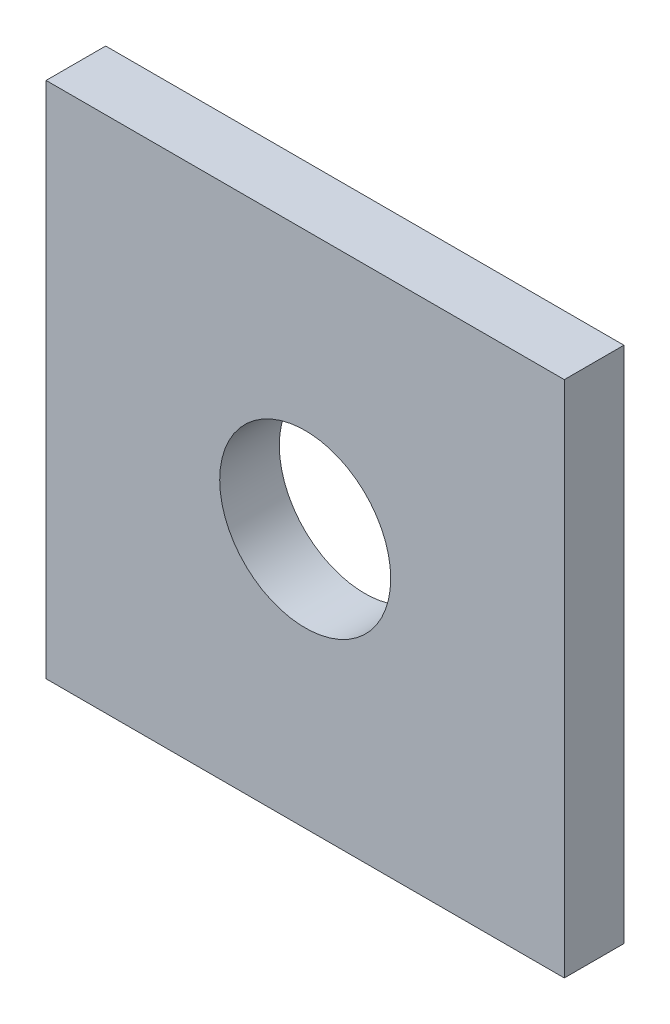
ISO-10303-21;
HEADER;
FILE_DESCRIPTION(('STEP AP214'),'2;1');
FILE_NAME('part.step','',(''),(''),'','','');
FILE_SCHEMA(('AUTOMOTIVE_DESIGN { 1 0 10303 214 1 1 1 1 }'));
ENDSEC;
DATA;
#1=APPLICATION_CONTEXT('core data for automotive mechanical design processes');
#2=APPLICATION_PROTOCOL_DEFINITION('international standard','automotive_design',2000,#1);
#3=PRODUCT_CONTEXT('',#1,'mechanical');
#4=PRODUCT('Part','Part','',(#3));
#5=PRODUCT_RELATED_PRODUCT_CATEGORY('part','',(#4));
#6=PRODUCT_DEFINITION_FORMATION('','',#4);
#7=PRODUCT_DEFINITION_CONTEXT('part definition',#1,'design');
#8=PRODUCT_DEFINITION('design','',#6,#7);
#9=PRODUCT_DEFINITION_SHAPE('','',#8);
#10=(LENGTH_UNIT() NAMED_UNIT(*) SI_UNIT(.MILLI.,.METRE.));
#11=(NAMED_UNIT(*) PLANE_ANGLE_UNIT() SI_UNIT($,.RADIAN.));
#12=(NAMED_UNIT(*) SI_UNIT($,.STERADIAN.) SOLID_ANGLE_UNIT());
#13=UNCERTAINTY_MEASURE_WITH_UNIT(LENGTH_MEASURE(1.E-05),#10,'distance_accuracy_value','');
#14=(GEOMETRIC_REPRESENTATION_CONTEXT(3) GLOBAL_UNCERTAINTY_ASSIGNED_CONTEXT((#13)) GLOBAL_UNIT_ASSIGNED_CONTEXT((#10,
#11,#12)) REPRESENTATION_CONTEXT('',''));
#15=CARTESIAN_POINT('',(0.,0.,0.));
#16=DIRECTION('',(0.,0.,1.));
#17=DIRECTION('',(1.,0.,0.));
#18=AXIS2_PLACEMENT_3D('',#15,#16,#17);
#19=CARTESIAN_POINT('',(-10.,20.,2.3));
#20=DIRECTION('',(0.,0.,-1.));
#21=DIRECTION('',(-1.,0.,0.));
#22=AXIS2_PLACEMENT_3D('',#19,#20,#21);
#23=PLANE('',#22);
#24=DIRECTION('',(0.,-1.,0.));
#25=VECTOR('',#24,1.);
#26=CARTESIAN_POINT('',(-10.,20.,2.3));
#27=LINE('',#26,#25);
#28=CARTESIAN_POINT('',(-10.,20.,2.3));
#29=VERTEX_POINT('',#28);
#30=CARTESIAN_POINT('',(-10.,0.,2.3));
#31=VERTEX_POINT('',#30);
#32=EDGE_CURVE('E84',#29,#31,#27,.T.);
#33=ORIENTED_EDGE('',*,*,#32,.T.);
#34=DIRECTION('',(1.,0.,0.));
#35=VECTOR('',#34,1.);
#36=CARTESIAN_POINT('',(-10.,0.,2.3));
#37=LINE('',#36,#35);
#38=CARTESIAN_POINT('',(10.,0.,2.3));
#39=VERTEX_POINT('',#38);
#40=EDGE_CURVE('E79',#31,#39,#37,.T.);
#41=ORIENTED_EDGE('',*,*,#40,.T.);
#42=DIRECTION('',(0.,1.,0.));
#43=VECTOR('',#42,1.);
#44=CARTESIAN_POINT('',(10.,0.,2.3));
#45=LINE('',#44,#43);
#46=CARTESIAN_POINT('',(10.,20.,2.3));
#47=VERTEX_POINT('',#46);
#48=EDGE_CURVE('E82',#39,#47,#45,.T.);
#49=ORIENTED_EDGE('',*,*,#48,.T.);
#50=DIRECTION('',(-1.,0.,0.));
#51=VECTOR('',#50,1.);
#52=CARTESIAN_POINT('',(10.,20.,2.3));
#53=LINE('',#52,#51);
#54=EDGE_CURVE('E49',#47,#29,#53,.T.);
#55=ORIENTED_EDGE('',*,*,#54,.T.);
#56=EDGE_LOOP('',(#33,#41,#49,#55));
#57=FACE_BOUND('',#56,.T.);
#58=CARTESIAN_POINT('',(0.,10.,2.3));
#59=DIRECTION('',(0.,0.,1.));
#60=DIRECTION('',(1.,0.,0.));
#61=AXIS2_PLACEMENT_3D('',#58,#59,#60);
#62=CIRCLE('',#61,3.3);
#63=CARTESIAN_POINT('',(3.3,10.,2.3));
#64=VERTEX_POINT('',#63);
#65=EDGE_CURVE('E99',#64,#64,#62,.T.);
#66=ORIENTED_EDGE('',*,*,#65,.F.);
#67=EDGE_LOOP('',(#66));
#68=FACE_BOUND('',#67,.T.);
#69=ADVANCED_FACE('F32',(#57,#68),#23,.F.);
#70=CARTESIAN_POINT('',(-10.,20.,0.));
#71=DIRECTION('',(0.,0.,-1.));
#72=DIRECTION('',(-1.,0.,0.));
#73=AXIS2_PLACEMENT_3D('',#70,#71,#72);
#74=PLANE('',#73);
#75=DIRECTION('',(0.,-1.,0.));
#76=VECTOR('',#75,1.);
#77=CARTESIAN_POINT('',(-10.,20.,0.));
#78=LINE('',#77,#76);
#79=CARTESIAN_POINT('',(-10.,20.,0.));
#80=VERTEX_POINT('',#79);
#81=CARTESIAN_POINT('',(-10.,0.,0.));
#82=VERTEX_POINT('',#81);
#83=EDGE_CURVE('E96',#80,#82,#78,.T.);
#84=ORIENTED_EDGE('',*,*,#83,.F.);
#85=DIRECTION('',(-1.,0.,0.));
#86=VECTOR('',#85,1.);
#87=CARTESIAN_POINT('',(10.,20.,0.));
#88=LINE('',#87,#86);
#89=CARTESIAN_POINT('',(10.,20.,0.));
#90=VERTEX_POINT('',#89);
#91=EDGE_CURVE('E72',#90,#80,#88,.T.);
#92=ORIENTED_EDGE('',*,*,#91,.F.);
#93=DIRECTION('',(0.,1.,0.));
#94=VECTOR('',#93,1.);
#95=CARTESIAN_POINT('',(10.,0.,0.));
#96=LINE('',#95,#94);
#97=CARTESIAN_POINT('',(10.,0.,0.));
#98=VERTEX_POINT('',#97);
#99=EDGE_CURVE('E66',#98,#90,#96,.T.);
#100=ORIENTED_EDGE('',*,*,#99,.F.);
#101=DIRECTION('',(1.,0.,0.));
#102=VECTOR('',#101,1.);
#103=CARTESIAN_POINT('',(-10.,0.,0.));
#104=LINE('',#103,#102);
#105=EDGE_CURVE('E88',#82,#98,#104,.T.);
#106=ORIENTED_EDGE('',*,*,#105,.F.);
#107=EDGE_LOOP('',(#84,#92,#100,#106));
#108=FACE_BOUND('',#107,.T.);
#109=CARTESIAN_POINT('',(0.,10.,0.));
#110=DIRECTION('',(0.,0.,1.));
#111=DIRECTION('',(1.,0.,0.));
#112=AXIS2_PLACEMENT_3D('',#109,#110,#111);
#113=CIRCLE('',#112,3.3);
#114=CARTESIAN_POINT('',(3.3,10.,0.));
#115=VERTEX_POINT('',#114);
#116=EDGE_CURVE('E111',#115,#115,#113,.T.);
#117=ORIENTED_EDGE('',*,*,#116,.T.);
#118=EDGE_LOOP('',(#117));
#119=FACE_BOUND('',#118,.T.);
#120=ADVANCED_FACE('F107',(#108,#119),#74,.T.);
#121=CARTESIAN_POINT('',(-10.,20.,2.3));
#122=DIRECTION('',(1.,0.,0.));
#123=DIRECTION('',(0.,1.,0.));
#124=AXIS2_PLACEMENT_3D('',#121,#122,#123);
#125=PLANE('',#124);
#126=ORIENTED_EDGE('',*,*,#83,.T.);
#127=DIRECTION('',(0.,0.,-1.));
#128=VECTOR('',#127,1.);
#129=CARTESIAN_POINT('',(-10.,0.,2.3));
#130=LINE('',#129,#128);
#131=EDGE_CURVE('E11',#31,#82,#130,.T.);
#132=ORIENTED_EDGE('',*,*,#131,.F.);
#133=ORIENTED_EDGE('',*,*,#32,.F.);
#134=DIRECTION('',(0.,0.,-1.));
#135=VECTOR('',#134,1.);
#136=CARTESIAN_POINT('',(-10.,20.,2.3));
#137=LINE('',#136,#135);
#138=EDGE_CURVE('E92',#29,#80,#137,.T.);
#139=ORIENTED_EDGE('',*,*,#138,.T.);
#140=EDGE_LOOP('',(#126,#132,#133,#139));
#141=FACE_BOUND('',#140,.T.);
#142=ADVANCED_FACE('F34',(#141),#125,.F.);
#143=CARTESIAN_POINT('',(-10.,0.,2.3));
#144=DIRECTION('',(0.,1.,0.));
#145=DIRECTION('',(0.,0.,1.));
#146=AXIS2_PLACEMENT_3D('',#143,#144,#145);
#147=PLANE('',#146);
#148=ORIENTED_EDGE('',*,*,#105,.T.);
#149=DIRECTION('',(0.,0.,-1.));
#150=VECTOR('',#149,1.);
#151=CARTESIAN_POINT('',(10.,0.,2.3));
#152=LINE('',#151,#150);
#153=EDGE_CURVE('E41',#39,#98,#152,.T.);
#154=ORIENTED_EDGE('',*,*,#153,.F.);
#155=ORIENTED_EDGE('',*,*,#40,.F.);
#156=ORIENTED_EDGE('',*,*,#131,.T.);
#157=EDGE_LOOP('',(#148,#154,#155,#156));
#158=FACE_BOUND('',#157,.T.);
#159=ADVANCED_FACE('F87',(#158),#147,.F.);
#160=CARTESIAN_POINT('',(10.,0.,2.3));
#161=DIRECTION('',(-1.,0.,0.));
#162=DIRECTION('',(0.,-1.,0.));
#163=AXIS2_PLACEMENT_3D('',#160,#161,#162);
#164=PLANE('',#163);
#165=ORIENTED_EDGE('',*,*,#99,.T.);
#166=DIRECTION('',(0.,0.,-1.));
#167=VECTOR('',#166,1.);
#168=CARTESIAN_POINT('',(10.,20.,2.3));
#169=LINE('',#168,#167);
#170=EDGE_CURVE('E89',#47,#90,#169,.T.);
#171=ORIENTED_EDGE('',*,*,#170,.F.);
#172=ORIENTED_EDGE('',*,*,#48,.F.);
#173=ORIENTED_EDGE('',*,*,#153,.T.);
#174=EDGE_LOOP('',(#165,#171,#172,#173));
#175=FACE_BOUND('',#174,.T.);
#176=ADVANCED_FACE('F90',(#175),#164,.F.);
#177=CARTESIAN_POINT('',(10.,20.,2.3));
#178=DIRECTION('',(0.,-1.,0.));
#179=DIRECTION('',(0.,0.,-1.));
#180=AXIS2_PLACEMENT_3D('',#177,#178,#179);
#181=PLANE('',#180);
#182=ORIENTED_EDGE('',*,*,#91,.T.);
#183=ORIENTED_EDGE('',*,*,#138,.F.);
#184=ORIENTED_EDGE('',*,*,#54,.F.);
#185=ORIENTED_EDGE('',*,*,#170,.T.);
#186=EDGE_LOOP('',(#182,#183,#184,#185));
#187=FACE_BOUND('',#186,.T.);
#188=ADVANCED_FACE('F104',(#187),#181,.F.);
#189=CARTESIAN_POINT('',(0.,10.,2.3));
#190=DIRECTION('',(0.,0.,-1.));
#191=DIRECTION('',(-1.,0.,0.));
#192=AXIS2_PLACEMENT_3D('',#189,#190,#191);
#193=CYLINDRICAL_SURFACE('',#192,3.3);
#194=ORIENTED_EDGE('',*,*,#65,.T.);
#195=EDGE_LOOP('',(#194));
#196=FACE_BOUND('',#195,.T.);
#197=ORIENTED_EDGE('',*,*,#116,.F.);
#198=EDGE_LOOP('',(#197));
#199=FACE_BOUND('',#198,.T.);
#200=ADVANCED_FACE('F117',(#196,#199),#193,.F.);
#201=CLOSED_SHELL('',(#69,#120,#142,#159,#176,#188,#200));
#202=MANIFOLD_SOLID_BREP('B2',#201);
#203=ADVANCED_BREP_SHAPE_REPRESENTATION('',(#18,#202),#14);
#204=SHAPE_DEFINITION_REPRESENTATION(#9,#203);
ENDSEC;
END-ISO-10303-21;
